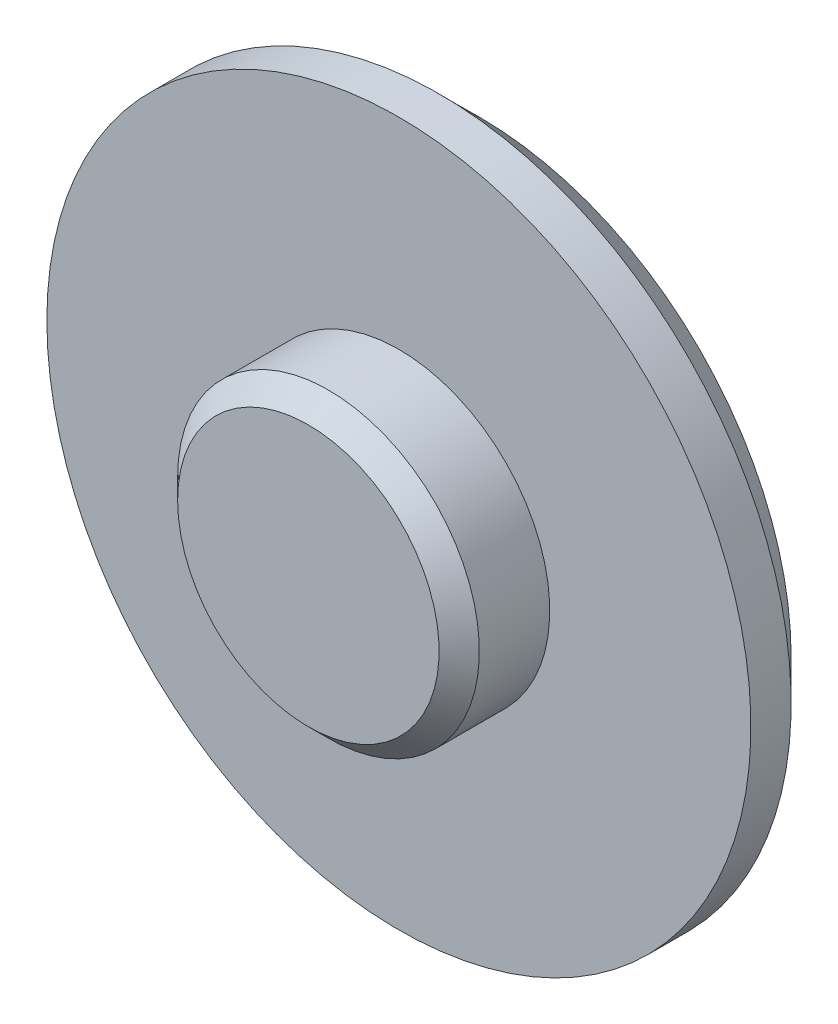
ISO-10303-21;
HEADER;
FILE_DESCRIPTION(('STEP AP214'),'2;1');
FILE_NAME('part.step','',(''),(''),'','','');
FILE_SCHEMA(('AUTOMOTIVE_DESIGN { 1 0 10303 214 1 1 1 1 }'));
ENDSEC;
DATA;
#1=APPLICATION_CONTEXT('core data for automotive mechanical design processes');
#2=APPLICATION_PROTOCOL_DEFINITION('international standard','automotive_design',2000,#1);
#3=PRODUCT_CONTEXT('',#1,'mechanical');
#4=PRODUCT('Part','Part','',(#3));
#5=PRODUCT_RELATED_PRODUCT_CATEGORY('part','',(#4));
#6=PRODUCT_DEFINITION_FORMATION('','',#4);
#7=PRODUCT_DEFINITION_CONTEXT('part definition',#1,'design');
#8=PRODUCT_DEFINITION('design','',#6,#7);
#9=PRODUCT_DEFINITION_SHAPE('','',#8);
#10=(LENGTH_UNIT() NAMED_UNIT(*) SI_UNIT(.MILLI.,.METRE.));
#11=(NAMED_UNIT(*) PLANE_ANGLE_UNIT() SI_UNIT($,.RADIAN.));
#12=(NAMED_UNIT(*) SI_UNIT($,.STERADIAN.) SOLID_ANGLE_UNIT());
#13=UNCERTAINTY_MEASURE_WITH_UNIT(LENGTH_MEASURE(1.E-05),#10,'distance_accuracy_value','');
#14=(GEOMETRIC_REPRESENTATION_CONTEXT(3) GLOBAL_UNCERTAINTY_ASSIGNED_CONTEXT((#13)) GLOBAL_UNIT_ASSIGNED_CONTEXT((#10,
#11,#12)) REPRESENTATION_CONTEXT('',''));
#15=CARTESIAN_POINT('',(0.,0.,0.));
#16=DIRECTION('',(0.,0.,1.));
#17=DIRECTION('',(1.,0.,0.));
#18=AXIS2_PLACEMENT_3D('',#15,#16,#17);
#19=CARTESIAN_POINT('',(0.,0.,7.5));
#20=DIRECTION('',(0.,0.,-1.));
#21=DIRECTION('',(-1.,0.,0.));
#22=AXIS2_PLACEMENT_3D('',#19,#20,#21);
#23=CONICAL_SURFACE('',#22,7.5,0.785398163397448);
#24=CARTESIAN_POINT('',(0.,0.,8.5));
#25=DIRECTION('',(0.,0.,-1.));
#26=DIRECTION('',(-1.,0.,0.));
#27=AXIS2_PLACEMENT_3D('',#24,#25,#26);
#28=CIRCLE('',#27,6.5);
#29=CARTESIAN_POINT('',(-6.5,0.,8.5));
#30=VERTEX_POINT('',#29);
#31=EDGE_CURVE('E52',#30,#30,#28,.T.);
#32=ORIENTED_EDGE('',*,*,#31,.T.);
#33=EDGE_LOOP('',(#32));
#34=FACE_BOUND('',#33,.T.);
#35=CARTESIAN_POINT('',(0.,0.,7.5));
#36=DIRECTION('',(0.,0.,-1.));
#37=DIRECTION('',(-1.,0.,0.));
#38=AXIS2_PLACEMENT_3D('',#35,#36,#37);
#39=CIRCLE('',#38,7.5);
#40=CARTESIAN_POINT('',(-7.5,0.,7.5));
#41=VERTEX_POINT('',#40);
#42=EDGE_CURVE('E10',#41,#41,#39,.T.);
#43=ORIENTED_EDGE('',*,*,#42,.F.);
#44=EDGE_LOOP('',(#43));
#45=FACE_BOUND('',#44,.T.);
#46=ADVANCED_FACE('F30',(#34,#45),#23,.T.);
#47=CARTESIAN_POINT('',(0.,0.,8.5));
#48=DIRECTION('',(0.,0.,-1.));
#49=DIRECTION('',(-1.,0.,0.));
#50=AXIS2_PLACEMENT_3D('',#47,#48,#49);
#51=CYLINDRICAL_SURFACE('',#50,7.5);
#52=ORIENTED_EDGE('',*,*,#42,.T.);
#53=EDGE_LOOP('',(#52));
#54=FACE_BOUND('',#53,.T.);
#55=CARTESIAN_POINT('',(0.,0.,4.));
#56=DIRECTION('',(0.,0.,-1.));
#57=DIRECTION('',(-1.,0.,0.));
#58=AXIS2_PLACEMENT_3D('',#55,#56,#57);
#59=CIRCLE('',#58,7.5);
#60=CARTESIAN_POINT('',(-7.5,0.,4.));
#61=VERTEX_POINT('',#60);
#62=EDGE_CURVE('E36',#61,#61,#59,.T.);
#63=ORIENTED_EDGE('',*,*,#62,.F.);
#64=EDGE_LOOP('',(#63));
#65=FACE_BOUND('',#64,.T.);
#66=ADVANCED_FACE('F69',(#54,#65),#51,.T.);
#67=CARTESIAN_POINT('',(17.5,0.,4.));
#68=DIRECTION('',(0.,0.,1.));
#69=DIRECTION('',(1.,0.,0.));
#70=AXIS2_PLACEMENT_3D('',#67,#68,#69);
#71=PLANE('',#70);
#72=ORIENTED_EDGE('',*,*,#62,.T.);
#73=EDGE_LOOP('',(#72));
#74=FACE_BOUND('',#73,.T.);
#75=CARTESIAN_POINT('',(0.,0.,4.));
#76=DIRECTION('',(0.,0.,-1.));
#77=DIRECTION('',(-1.,0.,0.));
#78=AXIS2_PLACEMENT_3D('',#75,#76,#77);
#79=CIRCLE('',#78,17.5);
#80=CARTESIAN_POINT('',(-17.5,0.,4.));
#81=VERTEX_POINT('',#80);
#82=EDGE_CURVE('E40',#81,#81,#79,.T.);
#83=ORIENTED_EDGE('',*,*,#82,.F.);
#84=EDGE_LOOP('',(#83));
#85=FACE_BOUND('',#84,.T.);
#86=ADVANCED_FACE('F73',(#74,#85),#71,.T.);
#87=CARTESIAN_POINT('',(0.,0.,8.5));
#88=DIRECTION('',(0.,0.,-1.));
#89=DIRECTION('',(-1.,0.,0.));
#90=AXIS2_PLACEMENT_3D('',#87,#88,#89);
#91=CYLINDRICAL_SURFACE('',#90,17.5);
#92=ORIENTED_EDGE('',*,*,#82,.T.);
#93=EDGE_LOOP('',(#92));
#94=FACE_BOUND('',#93,.T.);
#95=CARTESIAN_POINT('',(0.,0.,2.));
#96=DIRECTION('',(0.,0.,-1.));
#97=DIRECTION('',(-1.,0.,0.));
#98=AXIS2_PLACEMENT_3D('',#95,#96,#97);
#99=CIRCLE('',#98,17.5);
#100=CARTESIAN_POINT('',(-17.5,0.,2.));
#101=VERTEX_POINT('',#100);
#102=EDGE_CURVE('E44',#101,#101,#99,.T.);
#103=ORIENTED_EDGE('',*,*,#102,.F.);
#104=EDGE_LOOP('',(#103));
#105=FACE_BOUND('',#104,.T.);
#106=ADVANCED_FACE('F77',(#94,#105),#91,.T.);
#107=CARTESIAN_POINT('',(0.,0.,0.));
#108=DIRECTION('',(0.,0.,1.));
#109=DIRECTION('',(1.,0.,0.));
#110=AXIS2_PLACEMENT_3D('',#107,#108,#109);
#111=CONICAL_SURFACE('',#110,15.5,0.785398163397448);
#112=ORIENTED_EDGE('',*,*,#102,.T.);
#113=EDGE_LOOP('',(#112));
#114=FACE_BOUND('',#113,.T.);
#115=CARTESIAN_POINT('',(0.,0.,0.));
#116=DIRECTION('',(0.,0.,-1.));
#117=DIRECTION('',(-1.,0.,0.));
#118=AXIS2_PLACEMENT_3D('',#115,#116,#117);
#119=CIRCLE('',#118,15.5);
#120=CARTESIAN_POINT('',(-15.5,0.,0.));
#121=VERTEX_POINT('',#120);
#122=EDGE_CURVE('E49',#121,#121,#119,.T.);
#123=ORIENTED_EDGE('',*,*,#122,.F.);
#124=EDGE_LOOP('',(#123));
#125=FACE_BOUND('',#124,.T.);
#126=ADVANCED_FACE('F65',(#114,#125),#111,.T.);
#127=CARTESIAN_POINT('',(0.,0.,0.));
#128=DIRECTION('',(0.,0.,-1.));
#129=DIRECTION('',(-1.,0.,0.));
#130=AXIS2_PLACEMENT_3D('',#127,#128,#129);
#131=PLANE('',#130);
#132=ORIENTED_EDGE('',*,*,#122,.T.);
#133=EDGE_LOOP('',(#132));
#134=FACE_BOUND('',#133,.T.);
#135=ADVANCED_FACE('F60',(#134),#131,.T.);
#136=CARTESIAN_POINT('',(6.5,0.,8.5));
#137=DIRECTION('',(0.,0.,1.));
#138=DIRECTION('',(1.,0.,0.));
#139=AXIS2_PLACEMENT_3D('',#136,#137,#138);
#140=PLANE('',#139);
#141=ORIENTED_EDGE('',*,*,#31,.F.);
#142=EDGE_LOOP('',(#141));
#143=FACE_BOUND('',#142,.T.);
#144=ADVANCED_FACE('F58',(#143),#140,.T.);
#145=CLOSED_SHELL('',(#46,#66,#86,#106,#126,#135,#144));
#146=MANIFOLD_SOLID_BREP('B2',#145);
#147=ADVANCED_BREP_SHAPE_REPRESENTATION('',(#18,#146),#14);
#148=SHAPE_DEFINITION_REPRESENTATION(#9,#147);
ENDSEC;
END-ISO-10303-21;
